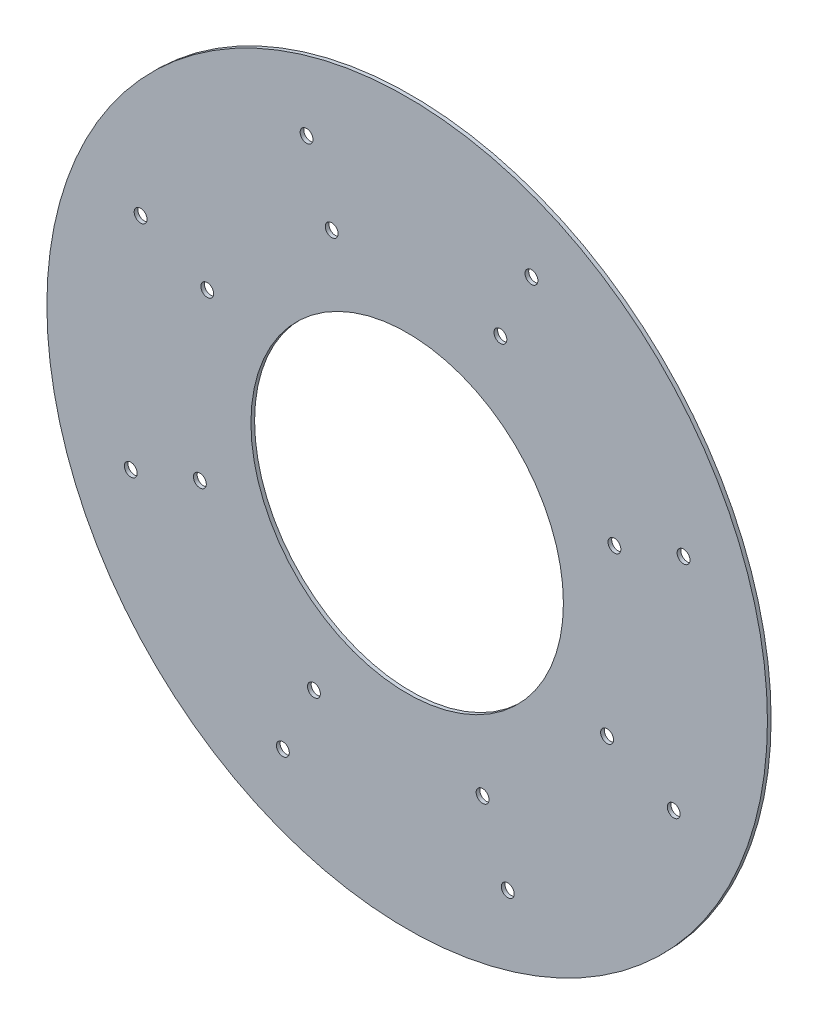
ISO-10303-21;
HEADER;
FILE_DESCRIPTION(('STEP AP214'),'2;1');
FILE_NAME('part.step','',(''),(''),'','','');
FILE_SCHEMA(('AUTOMOTIVE_DESIGN { 1 0 10303 214 1 1 1 1 }'));
ENDSEC;
DATA;
#1=APPLICATION_CONTEXT('core data for automotive mechanical design processes');
#2=APPLICATION_PROTOCOL_DEFINITION('international standard','automotive_design',2000,#1);
#3=PRODUCT_CONTEXT('',#1,'mechanical');
#4=PRODUCT('Part','Part','',(#3));
#5=PRODUCT_RELATED_PRODUCT_CATEGORY('part','',(#4));
#6=PRODUCT_DEFINITION_FORMATION('','',#4);
#7=PRODUCT_DEFINITION_CONTEXT('part definition',#1,'design');
#8=PRODUCT_DEFINITION('design','',#6,#7);
#9=PRODUCT_DEFINITION_SHAPE('','',#8);
#10=(LENGTH_UNIT() NAMED_UNIT(*) SI_UNIT(.MILLI.,.METRE.));
#11=(NAMED_UNIT(*) PLANE_ANGLE_UNIT() SI_UNIT($,.RADIAN.));
#12=(NAMED_UNIT(*) SI_UNIT($,.STERADIAN.) SOLID_ANGLE_UNIT());
#13=UNCERTAINTY_MEASURE_WITH_UNIT(LENGTH_MEASURE(1.E-05),#10,'distance_accuracy_value','');
#14=(GEOMETRIC_REPRESENTATION_CONTEXT(3) GLOBAL_UNCERTAINTY_ASSIGNED_CONTEXT((#13)) GLOBAL_UNIT_ASSIGNED_CONTEXT((#10,
#11,#12)) REPRESENTATION_CONTEXT('',''));
#15=CARTESIAN_POINT('',(0.,0.,0.));
#16=DIRECTION('',(0.,0.,1.));
#17=DIRECTION('',(1.,0.,0.));
#18=AXIS2_PLACEMENT_3D('',#15,#16,#17);
#19=CARTESIAN_POINT('',(0.,0.,10.));
#20=DIRECTION('',(0.,0.,1.));
#21=DIRECTION('',(1.,0.,0.));
#22=AXIS2_PLACEMENT_3D('',#19,#20,#21);
#23=PLANE('',#22);
#24=CARTESIAN_POINT('',(-751.754096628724,-273.616114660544,10.));
#25=DIRECTION('',(0.,0.,1.));
#26=DIRECTION('',(0.707106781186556,-0.707106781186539,0.));
#27=AXIS2_PLACEMENT_3D('',#24,#25,#26);
#28=CIRCLE('',#27,17.4999999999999);
#29=CARTESIAN_POINT('',(-739.379727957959,-285.990483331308,10.));
#30=VERTEX_POINT('',#29);
#31=EDGE_CURVE('E140',#30,#30,#28,.T.);
#32=ORIENTED_EDGE('',*,*,#31,.F.);
#33=EDGE_LOOP('',(#32));
#34=FACE_BOUND('',#33,.T.);
#35=CARTESIAN_POINT('',(-563.815572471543,-205.212085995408,10.));
#36=DIRECTION('',(0.,0.,1.));
#37=DIRECTION('',(0.707106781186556,-0.707106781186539,0.));
#38=AXIS2_PLACEMENT_3D('',#35,#36,#37);
#39=CIRCLE('',#38,17.5);
#40=CARTESIAN_POINT('',(-551.441203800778,-217.586454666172,10.));
#41=VERTEX_POINT('',#40);
#42=EDGE_CURVE('E134',#41,#41,#39,.T.);
#43=ORIENTED_EDGE('',*,*,#42,.F.);
#44=EDGE_LOOP('',(#43));
#45=FACE_BOUND('',#44,.T.);
#46=CARTESIAN_POINT('',(-725.046229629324,338.094609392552,10.));
#47=DIRECTION('',(0.,0.,1.));
#48=DIRECTION('',(0.,-1.,0.));
#49=AXIS2_PLACEMENT_3D('',#46,#47,#48);
#50=CIRCLE('',#49,17.4999999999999);
#51=CARTESIAN_POINT('',(-725.046229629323,320.594609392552,10.));
#52=VERTEX_POINT('',#51);
#53=EDGE_CURVE('E128',#52,#52,#50,.T.);
#54=ORIENTED_EDGE('',*,*,#53,.F.);
#55=EDGE_LOOP('',(#54));
#56=FACE_BOUND('',#55,.T.);
#57=CARTESIAN_POINT('',(-543.784672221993,253.570957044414,10.));
#58=DIRECTION('',(0.,0.,1.));
#59=DIRECTION('',(0.,-1.,0.));
#60=AXIS2_PLACEMENT_3D('',#57,#58,#59);
#61=CIRCLE('',#60,17.5);
#62=CARTESIAN_POINT('',(-543.784672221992,236.070957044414,10.));
#63=VERTEX_POINT('',#62);
#64=EDGE_CURVE('E122',#63,#63,#61,.T.);
#65=ORIENTED_EDGE('',*,*,#64,.F.);
#66=EDGE_LOOP('',(#65));
#67=FACE_BOUND('',#66,.T.);
#68=CARTESIAN_POINT('',(-273.616114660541,751.754096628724,10.));
#69=DIRECTION('',(0.,0.,1.));
#70=DIRECTION('',(-0.707106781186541,-0.707106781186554,0.));
#71=AXIS2_PLACEMENT_3D('',#68,#69,#70);
#72=CIRCLE('',#71,17.4999999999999);
#73=CARTESIAN_POINT('',(-285.990483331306,739.37972795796,10.));
#74=VERTEX_POINT('',#73);
#75=EDGE_CURVE('E116',#74,#74,#72,.T.);
#76=ORIENTED_EDGE('',*,*,#75,.F.);
#77=EDGE_LOOP('',(#76));
#78=FACE_BOUND('',#77,.T.);
#79=CARTESIAN_POINT('',(-205.212085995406,563.815572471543,10.));
#80=DIRECTION('',(0.,0.,1.));
#81=DIRECTION('',(-0.707106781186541,-0.707106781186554,0.));
#82=AXIS2_PLACEMENT_3D('',#79,#80,#81);
#83=CIRCLE('',#82,17.5);
#84=CARTESIAN_POINT('',(-217.58645466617,551.441203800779,10.));
#85=VERTEX_POINT('',#84);
#86=EDGE_CURVE('E110',#85,#85,#83,.T.);
#87=ORIENTED_EDGE('',*,*,#86,.F.);
#88=EDGE_LOOP('',(#87));
#89=FACE_BOUND('',#88,.T.);
#90=CARTESIAN_POINT('',(338.09460939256,725.04622962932,10.));
#91=DIRECTION('',(0.,0.,1.));
#92=DIRECTION('',(-1.,0.,0.));
#93=AXIS2_PLACEMENT_3D('',#90,#91,#92);
#94=CIRCLE('',#93,17.4999999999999);
#95=CARTESIAN_POINT('',(320.59460939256,725.04622962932,10.));
#96=VERTEX_POINT('',#95);
#97=EDGE_CURVE('E104',#96,#96,#94,.T.);
#98=ORIENTED_EDGE('',*,*,#97,.F.);
#99=EDGE_LOOP('',(#98));
#100=FACE_BOUND('',#99,.T.);
#101=CARTESIAN_POINT('',(253.57095704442,543.78467222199,10.));
#102=DIRECTION('',(0.,0.,1.));
#103=DIRECTION('',(-1.,0.,0.));
#104=AXIS2_PLACEMENT_3D('',#101,#102,#103);
#105=CIRCLE('',#104,17.5);
#106=CARTESIAN_POINT('',(236.07095704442,543.78467222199,10.));
#107=VERTEX_POINT('',#106);
#108=EDGE_CURVE('E98',#107,#107,#105,.T.);
#109=ORIENTED_EDGE('',*,*,#108,.F.);
#110=EDGE_LOOP('',(#109));
#111=FACE_BOUND('',#110,.T.);
#112=CARTESIAN_POINT('',(751.754096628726,273.616114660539,10.));
#113=DIRECTION('',(0.,0.,1.));
#114=DIRECTION('',(-0.707106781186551,0.707106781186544,0.));
#115=AXIS2_PLACEMENT_3D('',#112,#113,#114);
#116=CIRCLE('',#115,17.4999999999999);
#117=CARTESIAN_POINT('',(739.379727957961,285.990483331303,10.));
#118=VERTEX_POINT('',#117);
#119=EDGE_CURVE('E92',#118,#118,#116,.T.);
#120=ORIENTED_EDGE('',*,*,#119,.F.);
#121=EDGE_LOOP('',(#120));
#122=FACE_BOUND('',#121,.T.);
#123=CARTESIAN_POINT('',(563.815572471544,205.212085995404,10.));
#124=DIRECTION('',(0.,0.,1.));
#125=DIRECTION('',(-0.707106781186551,0.707106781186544,0.));
#126=AXIS2_PLACEMENT_3D('',#123,#124,#125);
#127=CIRCLE('',#126,17.5);
#128=CARTESIAN_POINT('',(551.441203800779,217.586454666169,10.));
#129=VERTEX_POINT('',#128);
#130=EDGE_CURVE('E86',#129,#129,#127,.T.);
#131=ORIENTED_EDGE('',*,*,#130,.F.);
#132=EDGE_LOOP('',(#131));
#133=FACE_BOUND('',#132,.T.);
#134=CARTESIAN_POINT('',(725.046229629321,-338.094609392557,10.));
#135=DIRECTION('',(0.,0.,1.));
#136=DIRECTION('',(0.,1.,0.));
#137=AXIS2_PLACEMENT_3D('',#134,#135,#136);
#138=CIRCLE('',#137,17.4999999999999);
#139=CARTESIAN_POINT('',(725.046229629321,-320.594609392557,10.));
#140=VERTEX_POINT('',#139);
#141=EDGE_CURVE('E80',#140,#140,#138,.T.);
#142=ORIENTED_EDGE('',*,*,#141,.F.);
#143=EDGE_LOOP('',(#142));
#144=FACE_BOUND('',#143,.T.);
#145=CARTESIAN_POINT('',(543.784672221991,-253.570957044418,10.));
#146=DIRECTION('',(0.,0.,1.));
#147=DIRECTION('',(0.,1.,0.));
#148=AXIS2_PLACEMENT_3D('',#145,#146,#147);
#149=CIRCLE('',#148,17.5);
#150=CARTESIAN_POINT('',(543.784672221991,-236.070957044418,10.));
#151=VERTEX_POINT('',#150);
#152=EDGE_CURVE('E74',#151,#151,#149,.T.);
#153=ORIENTED_EDGE('',*,*,#152,.F.);
#154=EDGE_LOOP('',(#153));
#155=FACE_BOUND('',#154,.T.);
#156=CARTESIAN_POINT('',(273.616114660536,-751.754096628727,10.));
#157=DIRECTION('',(0.,0.,1.));
#158=DIRECTION('',(0.707106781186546,0.707106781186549,0.));
#159=AXIS2_PLACEMENT_3D('',#156,#157,#158);
#160=CIRCLE('',#159,17.4999999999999);
#161=CARTESIAN_POINT('',(285.990483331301,-739.379727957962,10.));
#162=VERTEX_POINT('',#161);
#163=EDGE_CURVE('E68',#162,#162,#160,.T.);
#164=ORIENTED_EDGE('',*,*,#163,.F.);
#165=EDGE_LOOP('',(#164));
#166=FACE_BOUND('',#165,.T.);
#167=CARTESIAN_POINT('',(205.212085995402,-563.815572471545,10.));
#168=DIRECTION('',(0.,0.,1.));
#169=DIRECTION('',(0.707106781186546,0.707106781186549,0.));
#170=AXIS2_PLACEMENT_3D('',#167,#168,#169);
#171=CIRCLE('',#170,17.5);
#172=CARTESIAN_POINT('',(217.586454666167,-551.44120380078,10.));
#173=VERTEX_POINT('',#172);
#174=EDGE_CURVE('E62',#173,#173,#171,.T.);
#175=ORIENTED_EDGE('',*,*,#174,.F.);
#176=EDGE_LOOP('',(#175));
#177=FACE_BOUND('',#176,.T.);
#178=CARTESIAN_POINT('',(-338.09460939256,-725.04622962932,10.));
#179=DIRECTION('',(0.,0.,1.));
#180=DIRECTION('',(1.,0.,0.));
#181=AXIS2_PLACEMENT_3D('',#178,#179,#180);
#182=CIRCLE('',#181,17.4999999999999);
#183=CARTESIAN_POINT('',(-320.59460939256,-725.04622962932,10.));
#184=VERTEX_POINT('',#183);
#185=EDGE_CURVE('E56',#184,#184,#182,.T.);
#186=ORIENTED_EDGE('',*,*,#185,.F.);
#187=EDGE_LOOP('',(#186));
#188=FACE_BOUND('',#187,.T.);
#189=CARTESIAN_POINT('',(-253.57095704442,-543.78467222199,10.));
#190=DIRECTION('',(0.,0.,1.));
#191=DIRECTION('',(1.,0.,0.));
#192=AXIS2_PLACEMENT_3D('',#189,#190,#191);
#193=CIRCLE('',#192,17.5);
#194=CARTESIAN_POINT('',(-236.07095704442,-543.78467222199,10.));
#195=VERTEX_POINT('',#194);
#196=EDGE_CURVE('E50',#195,#195,#193,.T.);
#197=ORIENTED_EDGE('',*,*,#196,.F.);
#198=EDGE_LOOP('',(#197));
#199=FACE_BOUND('',#198,.T.);
#200=CARTESIAN_POINT('',(0.,0.,10.));
#201=DIRECTION('',(0.,0.,1.));
#202=DIRECTION('',(1.,0.,0.));
#203=AXIS2_PLACEMENT_3D('',#200,#201,#202);
#204=CIRCLE('',#203,980.);
#205=CARTESIAN_POINT('',(980.,0.,10.));
#206=VERTEX_POINT('',#205);
#207=EDGE_CURVE('E10',#206,#206,#204,.T.);
#208=ORIENTED_EDGE('',*,*,#207,.T.);
#209=EDGE_LOOP('',(#208));
#210=FACE_BOUND('',#209,.T.);
#211=CARTESIAN_POINT('',(0.,0.,10.));
#212=DIRECTION('',(0.,0.,1.));
#213=DIRECTION('',(1.,0.,0.));
#214=AXIS2_PLACEMENT_3D('',#211,#212,#213);
#215=CIRCLE('',#214,425.);
#216=CARTESIAN_POINT('',(425.,0.,10.));
#217=VERTEX_POINT('',#216);
#218=EDGE_CURVE('E42',#217,#217,#215,.T.);
#219=ORIENTED_EDGE('',*,*,#218,.F.);
#220=EDGE_LOOP('',(#219));
#221=FACE_BOUND('',#220,.T.);
#222=ADVANCED_FACE('F31',(#34,#45,#56,#67,#78,#89,#100,#111,#122,#133,#144,#155,#166,#177,#188,
#199,#210,#221),#23,.T.);
#223=CARTESIAN_POINT('',(0.,0.,0.));
#224=DIRECTION('',(0.,0.,1.));
#225=DIRECTION('',(1.,0.,0.));
#226=AXIS2_PLACEMENT_3D('',#223,#224,#225);
#227=PLANE('',#226);
#228=CARTESIAN_POINT('',(-751.754096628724,-273.616114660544,0.));
#229=DIRECTION('',(0.,0.,1.));
#230=DIRECTION('',(0.707106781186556,-0.707106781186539,0.));
#231=AXIS2_PLACEMENT_3D('',#228,#229,#230);
#232=CIRCLE('',#231,17.4999999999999);
#233=CARTESIAN_POINT('',(-739.379727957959,-285.990483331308,0.));
#234=VERTEX_POINT('',#233);
#235=EDGE_CURVE('E137',#234,#234,#232,.T.);
#236=ORIENTED_EDGE('',*,*,#235,.T.);
#237=EDGE_LOOP('',(#236));
#238=FACE_BOUND('',#237,.T.);
#239=CARTESIAN_POINT('',(-563.815572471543,-205.212085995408,0.));
#240=DIRECTION('',(0.,0.,1.));
#241=DIRECTION('',(0.707106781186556,-0.707106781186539,0.));
#242=AXIS2_PLACEMENT_3D('',#239,#240,#241);
#243=CIRCLE('',#242,17.5);
#244=CARTESIAN_POINT('',(-551.441203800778,-217.586454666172,0.));
#245=VERTEX_POINT('',#244);
#246=EDGE_CURVE('E131',#245,#245,#243,.T.);
#247=ORIENTED_EDGE('',*,*,#246,.T.);
#248=EDGE_LOOP('',(#247));
#249=FACE_BOUND('',#248,.T.);
#250=CARTESIAN_POINT('',(-725.046229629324,338.094609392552,0.));
#251=DIRECTION('',(0.,0.,1.));
#252=DIRECTION('',(0.,-1.,0.));
#253=AXIS2_PLACEMENT_3D('',#250,#251,#252);
#254=CIRCLE('',#253,17.4999999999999);
#255=CARTESIAN_POINT('',(-725.046229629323,320.594609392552,0.));
#256=VERTEX_POINT('',#255);
#257=EDGE_CURVE('E125',#256,#256,#254,.T.);
#258=ORIENTED_EDGE('',*,*,#257,.T.);
#259=EDGE_LOOP('',(#258));
#260=FACE_BOUND('',#259,.T.);
#261=CARTESIAN_POINT('',(-543.784672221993,253.570957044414,0.));
#262=DIRECTION('',(0.,0.,1.));
#263=DIRECTION('',(0.,-1.,0.));
#264=AXIS2_PLACEMENT_3D('',#261,#262,#263);
#265=CIRCLE('',#264,17.5);
#266=CARTESIAN_POINT('',(-543.784672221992,236.070957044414,0.));
#267=VERTEX_POINT('',#266);
#268=EDGE_CURVE('E119',#267,#267,#265,.T.);
#269=ORIENTED_EDGE('',*,*,#268,.T.);
#270=EDGE_LOOP('',(#269));
#271=FACE_BOUND('',#270,.T.);
#272=CARTESIAN_POINT('',(-273.616114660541,751.754096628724,0.));
#273=DIRECTION('',(0.,0.,1.));
#274=DIRECTION('',(-0.707106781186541,-0.707106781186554,0.));
#275=AXIS2_PLACEMENT_3D('',#272,#273,#274);
#276=CIRCLE('',#275,17.4999999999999);
#277=CARTESIAN_POINT('',(-285.990483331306,739.37972795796,0.));
#278=VERTEX_POINT('',#277);
#279=EDGE_CURVE('E113',#278,#278,#276,.T.);
#280=ORIENTED_EDGE('',*,*,#279,.T.);
#281=EDGE_LOOP('',(#280));
#282=FACE_BOUND('',#281,.T.);
#283=CARTESIAN_POINT('',(-205.212085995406,563.815572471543,0.));
#284=DIRECTION('',(0.,0.,1.));
#285=DIRECTION('',(-0.707106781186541,-0.707106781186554,0.));
#286=AXIS2_PLACEMENT_3D('',#283,#284,#285);
#287=CIRCLE('',#286,17.5);
#288=CARTESIAN_POINT('',(-217.58645466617,551.441203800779,0.));
#289=VERTEX_POINT('',#288);
#290=EDGE_CURVE('E107',#289,#289,#287,.T.);
#291=ORIENTED_EDGE('',*,*,#290,.T.);
#292=EDGE_LOOP('',(#291));
#293=FACE_BOUND('',#292,.T.);
#294=CARTESIAN_POINT('',(338.09460939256,725.04622962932,0.));
#295=DIRECTION('',(0.,0.,1.));
#296=DIRECTION('',(-1.,0.,0.));
#297=AXIS2_PLACEMENT_3D('',#294,#295,#296);
#298=CIRCLE('',#297,17.4999999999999);
#299=CARTESIAN_POINT('',(320.59460939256,725.04622962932,0.));
#300=VERTEX_POINT('',#299);
#301=EDGE_CURVE('E101',#300,#300,#298,.T.);
#302=ORIENTED_EDGE('',*,*,#301,.T.);
#303=EDGE_LOOP('',(#302));
#304=FACE_BOUND('',#303,.T.);
#305=CARTESIAN_POINT('',(253.57095704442,543.78467222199,0.));
#306=DIRECTION('',(0.,0.,1.));
#307=DIRECTION('',(-1.,0.,0.));
#308=AXIS2_PLACEMENT_3D('',#305,#306,#307);
#309=CIRCLE('',#308,17.5);
#310=CARTESIAN_POINT('',(236.07095704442,543.78467222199,0.));
#311=VERTEX_POINT('',#310);
#312=EDGE_CURVE('E95',#311,#311,#309,.T.);
#313=ORIENTED_EDGE('',*,*,#312,.T.);
#314=EDGE_LOOP('',(#313));
#315=FACE_BOUND('',#314,.T.);
#316=CARTESIAN_POINT('',(751.754096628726,273.616114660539,0.));
#317=DIRECTION('',(0.,0.,1.));
#318=DIRECTION('',(-0.707106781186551,0.707106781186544,0.));
#319=AXIS2_PLACEMENT_3D('',#316,#317,#318);
#320=CIRCLE('',#319,17.4999999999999);
#321=CARTESIAN_POINT('',(739.379727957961,285.990483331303,0.));
#322=VERTEX_POINT('',#321);
#323=EDGE_CURVE('E89',#322,#322,#320,.T.);
#324=ORIENTED_EDGE('',*,*,#323,.T.);
#325=EDGE_LOOP('',(#324));
#326=FACE_BOUND('',#325,.T.);
#327=CARTESIAN_POINT('',(563.815572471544,205.212085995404,0.));
#328=DIRECTION('',(0.,0.,1.));
#329=DIRECTION('',(-0.707106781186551,0.707106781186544,0.));
#330=AXIS2_PLACEMENT_3D('',#327,#328,#329);
#331=CIRCLE('',#330,17.5);
#332=CARTESIAN_POINT('',(551.441203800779,217.586454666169,0.));
#333=VERTEX_POINT('',#332);
#334=EDGE_CURVE('E83',#333,#333,#331,.T.);
#335=ORIENTED_EDGE('',*,*,#334,.T.);
#336=EDGE_LOOP('',(#335));
#337=FACE_BOUND('',#336,.T.);
#338=CARTESIAN_POINT('',(725.046229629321,-338.094609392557,0.));
#339=DIRECTION('',(0.,0.,1.));
#340=DIRECTION('',(0.,1.,0.));
#341=AXIS2_PLACEMENT_3D('',#338,#339,#340);
#342=CIRCLE('',#341,17.4999999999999);
#343=CARTESIAN_POINT('',(725.046229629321,-320.594609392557,0.));
#344=VERTEX_POINT('',#343);
#345=EDGE_CURVE('E77',#344,#344,#342,.T.);
#346=ORIENTED_EDGE('',*,*,#345,.T.);
#347=EDGE_LOOP('',(#346));
#348=FACE_BOUND('',#347,.T.);
#349=CARTESIAN_POINT('',(543.784672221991,-253.570957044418,0.));
#350=DIRECTION('',(0.,0.,1.));
#351=DIRECTION('',(0.,1.,0.));
#352=AXIS2_PLACEMENT_3D('',#349,#350,#351);
#353=CIRCLE('',#352,17.5);
#354=CARTESIAN_POINT('',(543.784672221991,-236.070957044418,0.));
#355=VERTEX_POINT('',#354);
#356=EDGE_CURVE('E71',#355,#355,#353,.T.);
#357=ORIENTED_EDGE('',*,*,#356,.T.);
#358=EDGE_LOOP('',(#357));
#359=FACE_BOUND('',#358,.T.);
#360=CARTESIAN_POINT('',(273.616114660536,-751.754096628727,0.));
#361=DIRECTION('',(0.,0.,1.));
#362=DIRECTION('',(0.707106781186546,0.707106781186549,0.));
#363=AXIS2_PLACEMENT_3D('',#360,#361,#362);
#364=CIRCLE('',#363,17.4999999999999);
#365=CARTESIAN_POINT('',(285.990483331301,-739.379727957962,0.));
#366=VERTEX_POINT('',#365);
#367=EDGE_CURVE('E65',#366,#366,#364,.T.);
#368=ORIENTED_EDGE('',*,*,#367,.T.);
#369=EDGE_LOOP('',(#368));
#370=FACE_BOUND('',#369,.T.);
#371=CARTESIAN_POINT('',(205.212085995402,-563.815572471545,0.));
#372=DIRECTION('',(0.,0.,1.));
#373=DIRECTION('',(0.707106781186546,0.707106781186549,0.));
#374=AXIS2_PLACEMENT_3D('',#371,#372,#373);
#375=CIRCLE('',#374,17.5);
#376=CARTESIAN_POINT('',(217.586454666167,-551.44120380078,0.));
#377=VERTEX_POINT('',#376);
#378=EDGE_CURVE('E59',#377,#377,#375,.T.);
#379=ORIENTED_EDGE('',*,*,#378,.T.);
#380=EDGE_LOOP('',(#379));
#381=FACE_BOUND('',#380,.T.);
#382=CARTESIAN_POINT('',(-338.09460939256,-725.04622962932,0.));
#383=DIRECTION('',(0.,0.,1.));
#384=DIRECTION('',(1.,0.,0.));
#385=AXIS2_PLACEMENT_3D('',#382,#383,#384);
#386=CIRCLE('',#385,17.4999999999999);
#387=CARTESIAN_POINT('',(-320.59460939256,-725.04622962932,0.));
#388=VERTEX_POINT('',#387);
#389=EDGE_CURVE('E53',#388,#388,#386,.T.);
#390=ORIENTED_EDGE('',*,*,#389,.T.);
#391=EDGE_LOOP('',(#390));
#392=FACE_BOUND('',#391,.T.);
#393=CARTESIAN_POINT('',(-253.57095704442,-543.78467222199,0.));
#394=DIRECTION('',(0.,0.,1.));
#395=DIRECTION('',(1.,0.,0.));
#396=AXIS2_PLACEMENT_3D('',#393,#394,#395);
#397=CIRCLE('',#396,17.5);
#398=CARTESIAN_POINT('',(-236.07095704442,-543.78467222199,0.));
#399=VERTEX_POINT('',#398);
#400=EDGE_CURVE('E47',#399,#399,#397,.T.);
#401=ORIENTED_EDGE('',*,*,#400,.T.);
#402=EDGE_LOOP('',(#401));
#403=FACE_BOUND('',#402,.T.);
#404=CARTESIAN_POINT('',(0.,0.,0.));
#405=DIRECTION('',(0.,0.,1.));
#406=DIRECTION('',(1.,0.,0.));
#407=AXIS2_PLACEMENT_3D('',#404,#405,#406);
#408=CIRCLE('',#407,980.);
#409=CARTESIAN_POINT('',(980.,0.,0.));
#410=VERTEX_POINT('',#409);
#411=EDGE_CURVE('E35',#410,#410,#408,.T.);
#412=ORIENTED_EDGE('',*,*,#411,.F.);
#413=EDGE_LOOP('',(#412));
#414=FACE_BOUND('',#413,.T.);
#415=CARTESIAN_POINT('',(0.,0.,0.));
#416=DIRECTION('',(0.,0.,1.));
#417=DIRECTION('',(1.,0.,0.));
#418=AXIS2_PLACEMENT_3D('',#415,#416,#417);
#419=CIRCLE('',#418,425.);
#420=CARTESIAN_POINT('',(425.,0.,0.));
#421=VERTEX_POINT('',#420);
#422=EDGE_CURVE('E44',#421,#421,#419,.T.);
#423=ORIENTED_EDGE('',*,*,#422,.T.);
#424=EDGE_LOOP('',(#423));
#425=FACE_BOUND('',#424,.T.);
#426=ADVANCED_FACE('F146',(#238,#249,#260,#271,#282,#293,#304,#315,#326,#337,#348,#359,#370,
#381,#392,#403,#414,#425),#227,.F.);
#427=CARTESIAN_POINT('',(0.,0.,10.));
#428=DIRECTION('',(0.,0.,-1.));
#429=DIRECTION('',(-1.,0.,0.));
#430=AXIS2_PLACEMENT_3D('',#427,#428,#429);
#431=CYLINDRICAL_SURFACE('',#430,980.);
#432=ORIENTED_EDGE('',*,*,#207,.F.);
#433=EDGE_LOOP('',(#432));
#434=FACE_BOUND('',#433,.T.);
#435=ORIENTED_EDGE('',*,*,#411,.T.);
#436=EDGE_LOOP('',(#435));
#437=FACE_BOUND('',#436,.T.);
#438=ADVANCED_FACE('F33',(#434,#437),#431,.T.);
#439=CARTESIAN_POINT('',(0.,0.,10.));
#440=DIRECTION('',(0.,0.,-1.));
#441=DIRECTION('',(-1.,0.,0.));
#442=AXIS2_PLACEMENT_3D('',#439,#440,#441);
#443=CYLINDRICAL_SURFACE('',#442,425.);
#444=ORIENTED_EDGE('',*,*,#218,.T.);
#445=EDGE_LOOP('',(#444));
#446=FACE_BOUND('',#445,.T.);
#447=ORIENTED_EDGE('',*,*,#422,.F.);
#448=EDGE_LOOP('',(#447));
#449=FACE_BOUND('',#448,.T.);
#450=ADVANCED_FACE('F191',(#446,#449),#443,.F.);
#451=CARTESIAN_POINT('',(-253.57095704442,-543.78467222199,0.));
#452=DIRECTION('',(0.,0.,1.));
#453=DIRECTION('',(1.,0.,0.));
#454=AXIS2_PLACEMENT_3D('',#451,#452,#453);
#455=CYLINDRICAL_SURFACE('',#454,17.5);
#456=ORIENTED_EDGE('',*,*,#400,.F.);
#457=EDGE_LOOP('',(#456));
#458=FACE_BOUND('',#457,.T.);
#459=ORIENTED_EDGE('',*,*,#196,.T.);
#460=EDGE_LOOP('',(#459));
#461=FACE_BOUND('',#460,.T.);
#462=ADVANCED_FACE('F194',(#458,#461),#455,.F.);
#463=CARTESIAN_POINT('',(-338.09460939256,-725.04622962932,0.));
#464=DIRECTION('',(0.,0.,1.));
#465=DIRECTION('',(1.,0.,0.));
#466=AXIS2_PLACEMENT_3D('',#463,#464,#465);
#467=CYLINDRICAL_SURFACE('',#466,17.4999999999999);
#468=ORIENTED_EDGE('',*,*,#389,.F.);
#469=EDGE_LOOP('',(#468));
#470=FACE_BOUND('',#469,.T.);
#471=ORIENTED_EDGE('',*,*,#185,.T.);
#472=EDGE_LOOP('',(#471));
#473=FACE_BOUND('',#472,.T.);
#474=ADVANCED_FACE('F207',(#470,#473),#467,.F.);
#475=CARTESIAN_POINT('',(205.212085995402,-563.815572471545,0.));
#476=DIRECTION('',(0.,0.,1.));
#477=DIRECTION('',(1.,0.,0.));
#478=AXIS2_PLACEMENT_3D('',#475,#476,#477);
#479=CYLINDRICAL_SURFACE('',#478,17.5);
#480=ORIENTED_EDGE('',*,*,#378,.F.);
#481=EDGE_LOOP('',(#480));
#482=FACE_BOUND('',#481,.T.);
#483=ORIENTED_EDGE('',*,*,#174,.T.);
#484=EDGE_LOOP('',(#483));
#485=FACE_BOUND('',#484,.T.);
#486=ADVANCED_FACE('F211',(#482,#485),#479,.F.);
#487=CARTESIAN_POINT('',(273.616114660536,-751.754096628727,0.));
#488=DIRECTION('',(0.,0.,1.));
#489=DIRECTION('',(1.,0.,0.));
#490=AXIS2_PLACEMENT_3D('',#487,#488,#489);
#491=CYLINDRICAL_SURFACE('',#490,17.4999999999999);
#492=ORIENTED_EDGE('',*,*,#367,.F.);
#493=EDGE_LOOP('',(#492));
#494=FACE_BOUND('',#493,.T.);
#495=ORIENTED_EDGE('',*,*,#163,.T.);
#496=EDGE_LOOP('',(#495));
#497=FACE_BOUND('',#496,.T.);
#498=ADVANCED_FACE('F215',(#494,#497),#491,.F.);
#499=CARTESIAN_POINT('',(543.784672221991,-253.570957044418,0.));
#500=DIRECTION('',(0.,0.,1.));
#501=DIRECTION('',(1.,0.,0.));
#502=AXIS2_PLACEMENT_3D('',#499,#500,#501);
#503=CYLINDRICAL_SURFACE('',#502,17.5);
#504=ORIENTED_EDGE('',*,*,#356,.F.);
#505=EDGE_LOOP('',(#504));
#506=FACE_BOUND('',#505,.T.);
#507=ORIENTED_EDGE('',*,*,#152,.T.);
#508=EDGE_LOOP('',(#507));
#509=FACE_BOUND('',#508,.T.);
#510=ADVANCED_FACE('F219',(#506,#509),#503,.F.);
#511=CARTESIAN_POINT('',(725.046229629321,-338.094609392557,0.));
#512=DIRECTION('',(0.,0.,1.));
#513=DIRECTION('',(1.,0.,0.));
#514=AXIS2_PLACEMENT_3D('',#511,#512,#513);
#515=CYLINDRICAL_SURFACE('',#514,17.4999999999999);
#516=ORIENTED_EDGE('',*,*,#345,.F.);
#517=EDGE_LOOP('',(#516));
#518=FACE_BOUND('',#517,.T.);
#519=ORIENTED_EDGE('',*,*,#141,.T.);
#520=EDGE_LOOP('',(#519));
#521=FACE_BOUND('',#520,.T.);
#522=ADVANCED_FACE('F223',(#518,#521),#515,.F.);
#523=CARTESIAN_POINT('',(563.815572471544,205.212085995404,0.));
#524=DIRECTION('',(0.,0.,1.));
#525=DIRECTION('',(1.,0.,0.));
#526=AXIS2_PLACEMENT_3D('',#523,#524,#525);
#527=CYLINDRICAL_SURFACE('',#526,17.5);
#528=ORIENTED_EDGE('',*,*,#334,.F.);
#529=EDGE_LOOP('',(#528));
#530=FACE_BOUND('',#529,.T.);
#531=ORIENTED_EDGE('',*,*,#130,.T.);
#532=EDGE_LOOP('',(#531));
#533=FACE_BOUND('',#532,.T.);
#534=ADVANCED_FACE('F227',(#530,#533),#527,.F.);
#535=CARTESIAN_POINT('',(751.754096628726,273.616114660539,0.));
#536=DIRECTION('',(0.,0.,1.));
#537=DIRECTION('',(1.,0.,0.));
#538=AXIS2_PLACEMENT_3D('',#535,#536,#537);
#539=CYLINDRICAL_SURFACE('',#538,17.4999999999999);
#540=ORIENTED_EDGE('',*,*,#323,.F.);
#541=EDGE_LOOP('',(#540));
#542=FACE_BOUND('',#541,.T.);
#543=ORIENTED_EDGE('',*,*,#119,.T.);
#544=EDGE_LOOP('',(#543));
#545=FACE_BOUND('',#544,.T.);
#546=ADVANCED_FACE('F231',(#542,#545),#539,.F.);
#547=CARTESIAN_POINT('',(253.57095704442,543.78467222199,0.));
#548=DIRECTION('',(0.,0.,1.));
#549=DIRECTION('',(1.,0.,0.));
#550=AXIS2_PLACEMENT_3D('',#547,#548,#549);
#551=CYLINDRICAL_SURFACE('',#550,17.5);
#552=ORIENTED_EDGE('',*,*,#312,.F.);
#553=EDGE_LOOP('',(#552));
#554=FACE_BOUND('',#553,.T.);
#555=ORIENTED_EDGE('',*,*,#108,.T.);
#556=EDGE_LOOP('',(#555));
#557=FACE_BOUND('',#556,.T.);
#558=ADVANCED_FACE('F235',(#554,#557),#551,.F.);
#559=CARTESIAN_POINT('',(338.09460939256,725.04622962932,0.));
#560=DIRECTION('',(0.,0.,1.));
#561=DIRECTION('',(1.,0.,0.));
#562=AXIS2_PLACEMENT_3D('',#559,#560,#561);
#563=CYLINDRICAL_SURFACE('',#562,17.4999999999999);
#564=ORIENTED_EDGE('',*,*,#301,.F.);
#565=EDGE_LOOP('',(#564));
#566=FACE_BOUND('',#565,.T.);
#567=ORIENTED_EDGE('',*,*,#97,.T.);
#568=EDGE_LOOP('',(#567));
#569=FACE_BOUND('',#568,.T.);
#570=ADVANCED_FACE('F239',(#566,#569),#563,.F.);
#571=CARTESIAN_POINT('',(-205.212085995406,563.815572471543,0.));
#572=DIRECTION('',(0.,0.,1.));
#573=DIRECTION('',(1.,0.,0.));
#574=AXIS2_PLACEMENT_3D('',#571,#572,#573);
#575=CYLINDRICAL_SURFACE('',#574,17.5);
#576=ORIENTED_EDGE('',*,*,#290,.F.);
#577=EDGE_LOOP('',(#576));
#578=FACE_BOUND('',#577,.T.);
#579=ORIENTED_EDGE('',*,*,#86,.T.);
#580=EDGE_LOOP('',(#579));
#581=FACE_BOUND('',#580,.T.);
#582=ADVANCED_FACE('F243',(#578,#581),#575,.F.);
#583=CARTESIAN_POINT('',(-273.616114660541,751.754096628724,0.));
#584=DIRECTION('',(0.,0.,1.));
#585=DIRECTION('',(1.,0.,0.));
#586=AXIS2_PLACEMENT_3D('',#583,#584,#585);
#587=CYLINDRICAL_SURFACE('',#586,17.4999999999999);
#588=ORIENTED_EDGE('',*,*,#279,.F.);
#589=EDGE_LOOP('',(#588));
#590=FACE_BOUND('',#589,.T.);
#591=ORIENTED_EDGE('',*,*,#75,.T.);
#592=EDGE_LOOP('',(#591));
#593=FACE_BOUND('',#592,.T.);
#594=ADVANCED_FACE('F247',(#590,#593),#587,.F.);
#595=CARTESIAN_POINT('',(-543.784672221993,253.570957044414,0.));
#596=DIRECTION('',(0.,0.,1.));
#597=DIRECTION('',(1.,0.,0.));
#598=AXIS2_PLACEMENT_3D('',#595,#596,#597);
#599=CYLINDRICAL_SURFACE('',#598,17.5);
#600=ORIENTED_EDGE('',*,*,#268,.F.);
#601=EDGE_LOOP('',(#600));
#602=FACE_BOUND('',#601,.T.);
#603=ORIENTED_EDGE('',*,*,#64,.T.);
#604=EDGE_LOOP('',(#603));
#605=FACE_BOUND('',#604,.T.);
#606=ADVANCED_FACE('F251',(#602,#605),#599,.F.);
#607=CARTESIAN_POINT('',(-725.046229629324,338.094609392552,0.));
#608=DIRECTION('',(0.,0.,1.));
#609=DIRECTION('',(1.,0.,0.));
#610=AXIS2_PLACEMENT_3D('',#607,#608,#609);
#611=CYLINDRICAL_SURFACE('',#610,17.4999999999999);
#612=ORIENTED_EDGE('',*,*,#257,.F.);
#613=EDGE_LOOP('',(#612));
#614=FACE_BOUND('',#613,.T.);
#615=ORIENTED_EDGE('',*,*,#53,.T.);
#616=EDGE_LOOP('',(#615));
#617=FACE_BOUND('',#616,.T.);
#618=ADVANCED_FACE('F255',(#614,#617),#611,.F.);
#619=CARTESIAN_POINT('',(-563.815572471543,-205.212085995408,0.));
#620=DIRECTION('',(0.,0.,1.));
#621=DIRECTION('',(1.,0.,0.));
#622=AXIS2_PLACEMENT_3D('',#619,#620,#621);
#623=CYLINDRICAL_SURFACE('',#622,17.5);
#624=ORIENTED_EDGE('',*,*,#246,.F.);
#625=EDGE_LOOP('',(#624));
#626=FACE_BOUND('',#625,.T.);
#627=ORIENTED_EDGE('',*,*,#42,.T.);
#628=EDGE_LOOP('',(#627));
#629=FACE_BOUND('',#628,.T.);
#630=ADVANCED_FACE('F152',(#626,#629),#623,.F.);
#631=CARTESIAN_POINT('',(-751.754096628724,-273.616114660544,0.));
#632=DIRECTION('',(0.,0.,1.));
#633=DIRECTION('',(1.,0.,0.));
#634=AXIS2_PLACEMENT_3D('',#631,#632,#633);
#635=CYLINDRICAL_SURFACE('',#634,17.4999999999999);
#636=ORIENTED_EDGE('',*,*,#235,.F.);
#637=EDGE_LOOP('',(#636));
#638=FACE_BOUND('',#637,.T.);
#639=ORIENTED_EDGE('',*,*,#31,.T.);
#640=EDGE_LOOP('',(#639));
#641=FACE_BOUND('',#640,.T.);
#642=ADVANCED_FACE('F149',(#638,#641),#635,.F.);
#643=CLOSED_SHELL('',(#222,#426,#438,#450,#462,#474,#486,#498,#510,#522,#534,#546,#558,#570,
#582,#594,#606,#618,#630,#642));
#644=MANIFOLD_SOLID_BREP('B2',#643);
#645=ADVANCED_BREP_SHAPE_REPRESENTATION('',(#18,#644),#14);
#646=SHAPE_DEFINITION_REPRESENTATION(#9,#645);
ENDSEC;
END-ISO-10303-21;
